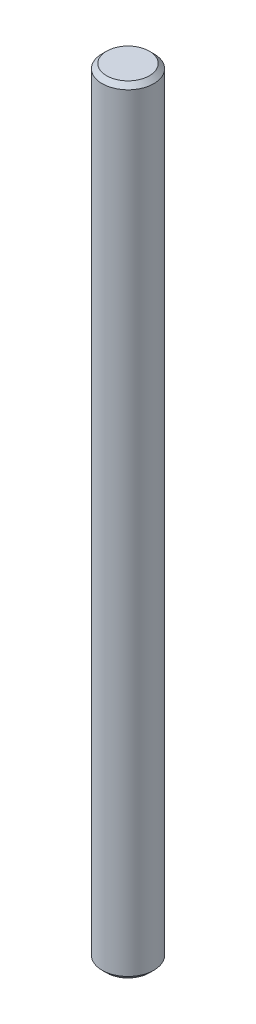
ISO-10303-21;
HEADER;
FILE_DESCRIPTION(('STEP AP214'),'2;1');
FILE_NAME('part.step','',(''),(''),'','','');
FILE_SCHEMA(('AUTOMOTIVE_DESIGN { 1 0 10303 214 1 1 1 1 }'));
ENDSEC;
DATA;
#1=APPLICATION_CONTEXT('core data for automotive mechanical design processes');
#2=APPLICATION_PROTOCOL_DEFINITION('international standard','automotive_design',2000,#1);
#3=PRODUCT_CONTEXT('',#1,'mechanical');
#4=PRODUCT('Part','Part','',(#3));
#5=PRODUCT_RELATED_PRODUCT_CATEGORY('part','',(#4));
#6=PRODUCT_DEFINITION_FORMATION('','',#4);
#7=PRODUCT_DEFINITION_CONTEXT('part definition',#1,'design');
#8=PRODUCT_DEFINITION('design','',#6,#7);
#9=PRODUCT_DEFINITION_SHAPE('','',#8);
#10=(LENGTH_UNIT() NAMED_UNIT(*) SI_UNIT(.MILLI.,.METRE.));
#11=(NAMED_UNIT(*) PLANE_ANGLE_UNIT() SI_UNIT($,.RADIAN.));
#12=(NAMED_UNIT(*) SI_UNIT($,.STERADIAN.) SOLID_ANGLE_UNIT());
#13=UNCERTAINTY_MEASURE_WITH_UNIT(LENGTH_MEASURE(1.E-05),#10,'distance_accuracy_value','');
#14=(GEOMETRIC_REPRESENTATION_CONTEXT(3) GLOBAL_UNCERTAINTY_ASSIGNED_CONTEXT((#13)) GLOBAL_UNIT_ASSIGNED_CONTEXT((#10,
#11,#12)) REPRESENTATION_CONTEXT('',''));
#15=CARTESIAN_POINT('',(0.,0.,0.));
#16=DIRECTION('',(0.,0.,1.));
#17=DIRECTION('',(1.,0.,0.));
#18=AXIS2_PLACEMENT_3D('',#15,#16,#17);
#19=CARTESIAN_POINT('',(0.,60.,0.));
#20=DIRECTION('',(0.,-1.,0.));
#21=DIRECTION('',(0.,0.,-1.));
#22=AXIS2_PLACEMENT_3D('',#19,#20,#21);
#23=CYLINDRICAL_SURFACE('',#22,2.);
#24=CARTESIAN_POINT('',(0.,0.349999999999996,0.));
#25=DIRECTION('',(0.,1.,0.));
#26=DIRECTION('',(0.,0.,1.));
#27=AXIS2_PLACEMENT_3D('',#24,#25,#26);
#28=CIRCLE('',#27,2.);
#29=CARTESIAN_POINT('',(0.,0.349999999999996,2.));
#30=VERTEX_POINT('',#29);
#31=EDGE_CURVE('E44',#30,#30,#28,.T.);
#32=ORIENTED_EDGE('',*,*,#31,.T.);
#33=EDGE_LOOP('',(#32));
#34=FACE_BOUND('',#33,.T.);
#35=CARTESIAN_POINT('',(0.,59.65,0.));
#36=DIRECTION('',(0.,1.,0.));
#37=DIRECTION('',(0.,0.,1.));
#38=AXIS2_PLACEMENT_3D('',#35,#36,#37);
#39=CIRCLE('',#38,2.);
#40=CARTESIAN_POINT('',(0.,59.65,2.));
#41=VERTEX_POINT('',#40);
#42=EDGE_CURVE('E48',#41,#41,#39,.F.);
#43=ORIENTED_EDGE('',*,*,#42,.T.);
#44=EDGE_LOOP('',(#43));
#45=FACE_BOUND('',#44,.T.);
#46=ADVANCED_FACE('F33',(#34,#45),#23,.T.);
#47=CARTESIAN_POINT('',(0.,60.,0.));
#48=DIRECTION('',(0.,1.,0.));
#49=DIRECTION('',(0.,0.,1.));
#50=AXIS2_PLACEMENT_3D('',#47,#48,#49);
#51=PLANE('',#50);
#52=CARTESIAN_POINT('',(0.,60.,0.));
#53=DIRECTION('',(0.,1.,0.));
#54=DIRECTION('',(0.,0.,1.));
#55=AXIS2_PLACEMENT_3D('',#52,#53,#54);
#56=CIRCLE('',#55,1.65000000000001);
#57=CARTESIAN_POINT('',(0.,60.,1.65000000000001));
#58=VERTEX_POINT('',#57);
#59=EDGE_CURVE('E10',#58,#58,#56,.T.);
#60=ORIENTED_EDGE('',*,*,#59,.T.);
#61=EDGE_LOOP('',(#60));
#62=FACE_BOUND('',#61,.T.);
#63=ADVANCED_FACE('F64',(#62),#51,.T.);
#64=CARTESIAN_POINT('',(0.,0.,0.));
#65=DIRECTION('',(0.,1.,0.));
#66=DIRECTION('',(0.,0.,1.));
#67=AXIS2_PLACEMENT_3D('',#64,#65,#66);
#68=PLANE('',#67);
#69=CARTESIAN_POINT('',(0.,0.,0.));
#70=DIRECTION('',(0.,1.,0.));
#71=DIRECTION('',(0.,0.,1.));
#72=AXIS2_PLACEMENT_3D('',#69,#70,#71);
#73=CIRCLE('',#72,1.65);
#74=CARTESIAN_POINT('',(0.,0.,1.65));
#75=VERTEX_POINT('',#74);
#76=EDGE_CURVE('E40',#75,#75,#73,.F.);
#77=ORIENTED_EDGE('',*,*,#76,.T.);
#78=EDGE_LOOP('',(#77));
#79=FACE_BOUND('',#78,.T.);
#80=ADVANCED_FACE('F61',(#79),#68,.F.);
#81=CARTESIAN_POINT('',(0.,0.349999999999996,0.));
#82=DIRECTION('',(0.,1.,0.));
#83=DIRECTION('',(0.,0.,1.));
#84=AXIS2_PLACEMENT_3D('',#81,#82,#83);
#85=CONICAL_SURFACE('',#84,2.,0.785398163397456);
#86=ORIENTED_EDGE('',*,*,#76,.F.);
#87=EDGE_LOOP('',(#86));
#88=FACE_BOUND('',#87,.T.);
#89=ORIENTED_EDGE('',*,*,#31,.F.);
#90=EDGE_LOOP('',(#89));
#91=FACE_BOUND('',#90,.T.);
#92=ADVANCED_FACE('F57',(#88,#91),#85,.T.);
#93=CARTESIAN_POINT('',(0.,60.,0.));
#94=DIRECTION('',(0.,-1.,0.));
#95=DIRECTION('',(0.,0.,-1.));
#96=AXIS2_PLACEMENT_3D('',#93,#94,#95);
#97=CONICAL_SURFACE('',#96,1.65000000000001,0.785398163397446);
#98=ORIENTED_EDGE('',*,*,#42,.F.);
#99=EDGE_LOOP('',(#98));
#100=FACE_BOUND('',#99,.T.);
#101=ORIENTED_EDGE('',*,*,#59,.F.);
#102=EDGE_LOOP('',(#101));
#103=FACE_BOUND('',#102,.T.);
#104=ADVANCED_FACE('F35',(#100,#103),#97,.T.);
#105=CLOSED_SHELL('',(#46,#63,#80,#92,#104));
#106=MANIFOLD_SOLID_BREP('B2',#105);
#107=ADVANCED_BREP_SHAPE_REPRESENTATION('',(#18,#106),#14);
#108=SHAPE_DEFINITION_REPRESENTATION(#9,#107);
ENDSEC;
END-ISO-10303-21;
